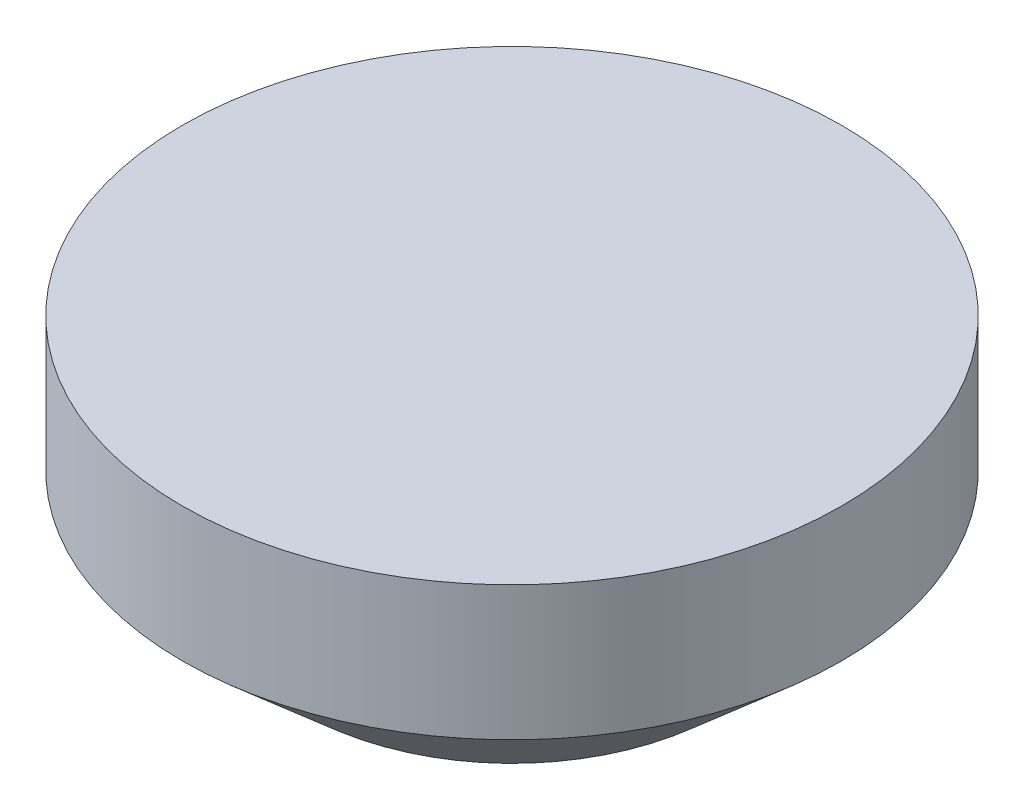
ISO-10303-21;
HEADER;
FILE_DESCRIPTION(('STEP AP214'),'2;1');
FILE_NAME('part.step','',(''),(''),'','','');
FILE_SCHEMA(('AUTOMOTIVE_DESIGN { 1 0 10303 214 1 1 1 1 }'));
ENDSEC;
DATA;
#1=APPLICATION_CONTEXT('core data for automotive mechanical design processes');
#2=APPLICATION_PROTOCOL_DEFINITION('international standard','automotive_design',2000,#1);
#3=PRODUCT_CONTEXT('',#1,'mechanical');
#4=PRODUCT('Part','Part','',(#3));
#5=PRODUCT_RELATED_PRODUCT_CATEGORY('part','',(#4));
#6=PRODUCT_DEFINITION_FORMATION('','',#4);
#7=PRODUCT_DEFINITION_CONTEXT('part definition',#1,'design');
#8=PRODUCT_DEFINITION('design','',#6,#7);
#9=PRODUCT_DEFINITION_SHAPE('','',#8);
#10=(LENGTH_UNIT() NAMED_UNIT(*) SI_UNIT(.MILLI.,.METRE.));
#11=(NAMED_UNIT(*) PLANE_ANGLE_UNIT() SI_UNIT($,.RADIAN.));
#12=(NAMED_UNIT(*) SI_UNIT($,.STERADIAN.) SOLID_ANGLE_UNIT());
#13=UNCERTAINTY_MEASURE_WITH_UNIT(LENGTH_MEASURE(1.E-05),#10,'distance_accuracy_value','');
#14=(GEOMETRIC_REPRESENTATION_CONTEXT(3) GLOBAL_UNCERTAINTY_ASSIGNED_CONTEXT((#13)) GLOBAL_UNIT_ASSIGNED_CONTEXT((#10,
#11,#12)) REPRESENTATION_CONTEXT('',''));
#15=CARTESIAN_POINT('',(0.,0.,0.));
#16=DIRECTION('',(0.,0.,1.));
#17=DIRECTION('',(1.,0.,0.));
#18=AXIS2_PLACEMENT_3D('',#15,#16,#17);
#19=CARTESIAN_POINT('',(0.,410.,0.));
#20=DIRECTION('',(0.,-1.,0.));
#21=DIRECTION('',(0.,0.,-1.));
#22=AXIS2_PLACEMENT_3D('',#19,#20,#21);
#23=PLANE('',#22);
#24=CARTESIAN_POINT('',(0.,410.,0.));
#25=DIRECTION('',(0.,-1.,0.));
#26=DIRECTION('',(0.,0.,-1.));
#27=AXIS2_PLACEMENT_3D('',#24,#25,#26);
#28=CIRCLE('',#27,565.);
#29=CARTESIAN_POINT('',(0.,410.,-565.));
#30=VERTEX_POINT('',#29);
#31=EDGE_CURVE('E10',#30,#30,#28,.T.);
#32=ORIENTED_EDGE('',*,*,#31,.F.);
#33=EDGE_LOOP('',(#32));
#34=FACE_BOUND('',#33,.T.);
#35=ADVANCED_FACE('F33',(#34),#23,.F.);
#36=CARTESIAN_POINT('',(0.,0.,0.));
#37=DIRECTION('',(0.,-1.,0.));
#38=DIRECTION('',(0.,0.,-1.));
#39=AXIS2_PLACEMENT_3D('',#36,#37,#38);
#40=CYLINDRICAL_SURFACE('',#39,565.);
#41=CARTESIAN_POINT('',(0.,180.,0.));
#42=DIRECTION('',(0.,-1.,0.));
#43=DIRECTION('',(0.,0.,-1.));
#44=AXIS2_PLACEMENT_3D('',#41,#42,#43);
#45=CIRCLE('',#44,565.);
#46=CARTESIAN_POINT('',(0.,180.,-565.));
#47=VERTEX_POINT('',#46);
#48=EDGE_CURVE('E39',#47,#47,#45,.T.);
#49=ORIENTED_EDGE('',*,*,#48,.F.);
#50=EDGE_LOOP('',(#49));
#51=FACE_BOUND('',#50,.T.);
#52=ORIENTED_EDGE('',*,*,#31,.T.);
#53=EDGE_LOOP('',(#52));
#54=FACE_BOUND('',#53,.T.);
#55=ADVANCED_FACE('F54',(#51,#54),#40,.T.);
#56=CARTESIAN_POINT('',(0.,180.,0.));
#57=DIRECTION('',(0.,1.,0.));
#58=DIRECTION('',(0.,0.,1.));
#59=AXIS2_PLACEMENT_3D('',#56,#57,#58);
#60=CONICAL_SURFACE('',#59,565.,0.850242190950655);
#61=CARTESIAN_POINT('',(0.,0.,0.));
#62=DIRECTION('',(0.,-1.,0.));
#63=DIRECTION('',(0.,0.,-1.));
#64=AXIS2_PLACEMENT_3D('',#61,#62,#63);
#65=CIRCLE('',#64,360.);
#66=CARTESIAN_POINT('',(0.,0.,-360.));
#67=VERTEX_POINT('',#66);
#68=EDGE_CURVE('E43',#67,#67,#65,.T.);
#69=ORIENTED_EDGE('',*,*,#68,.F.);
#70=EDGE_LOOP('',(#69));
#71=FACE_BOUND('',#70,.T.);
#72=ORIENTED_EDGE('',*,*,#48,.T.);
#73=EDGE_LOOP('',(#72));
#74=FACE_BOUND('',#73,.T.);
#75=ADVANCED_FACE('F52',(#71,#74),#60,.T.);
#76=CARTESIAN_POINT('',(-360.,0.,0.));
#77=DIRECTION('',(0.,1.,0.));
#78=DIRECTION('',(0.,0.,1.));
#79=AXIS2_PLACEMENT_3D('',#76,#77,#78);
#80=PLANE('',#79);
#81=ORIENTED_EDGE('',*,*,#68,.T.);
#82=EDGE_LOOP('',(#81));
#83=FACE_BOUND('',#82,.T.);
#84=ADVANCED_FACE('F50',(#83),#80,.F.);
#85=CLOSED_SHELL('',(#35,#55,#75,#84));
#86=MANIFOLD_SOLID_BREP('B2',#85);
#87=ADVANCED_BREP_SHAPE_REPRESENTATION('',(#18,#86),#14);
#88=SHAPE_DEFINITION_REPRESENTATION(#9,#87);
ENDSEC;
END-ISO-10303-21;
